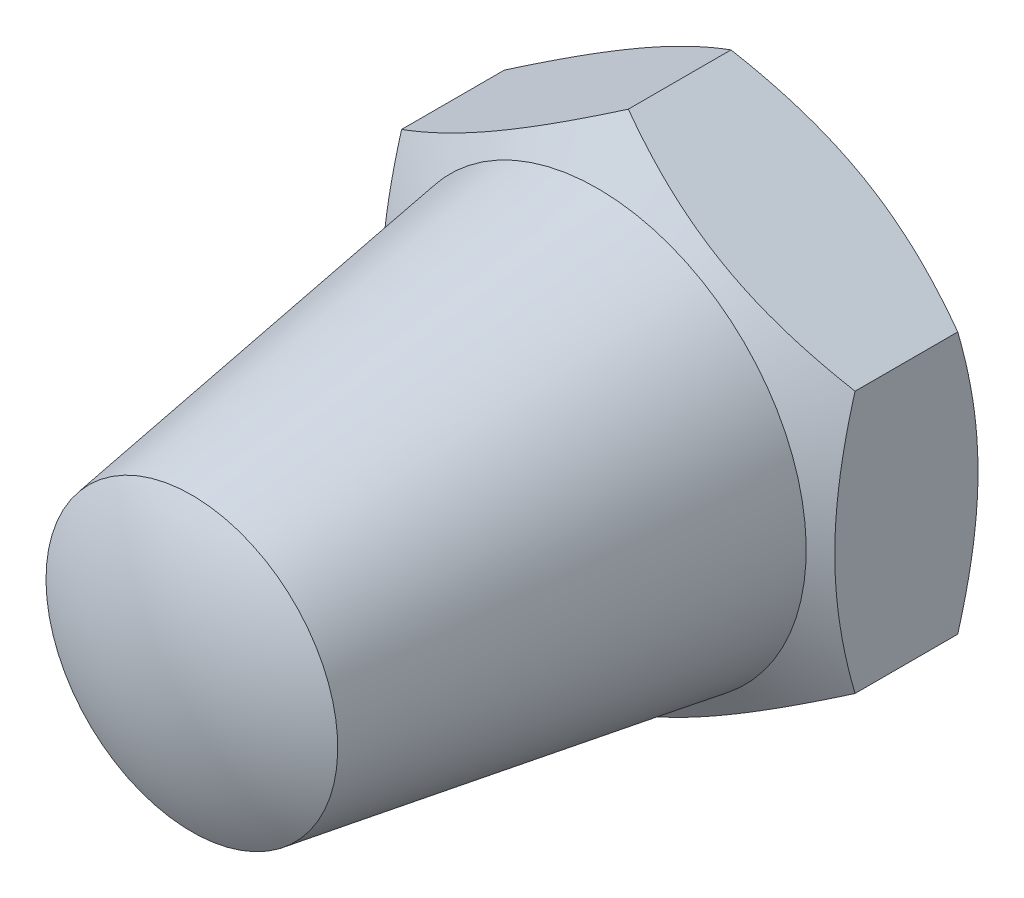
ISO-10303-21;
HEADER;
FILE_DESCRIPTION(('STEP AP214'),'2;1');
FILE_NAME('part.step','',(''),(''),'','','');
FILE_SCHEMA(('AUTOMOTIVE_DESIGN { 1 0 10303 214 1 1 1 1 }'));
ENDSEC;
DATA;
#1=APPLICATION_CONTEXT('core data for automotive mechanical design processes');
#2=APPLICATION_PROTOCOL_DEFINITION('international standard','automotive_design',2000,#1);
#3=PRODUCT_CONTEXT('',#1,'mechanical');
#4=PRODUCT('Part','Part','',(#3));
#5=PRODUCT_RELATED_PRODUCT_CATEGORY('part','',(#4));
#6=PRODUCT_DEFINITION_FORMATION('','',#4);
#7=PRODUCT_DEFINITION_CONTEXT('part definition',#1,'design');
#8=PRODUCT_DEFINITION('design','',#6,#7);
#9=PRODUCT_DEFINITION_SHAPE('','',#8);
#10=(LENGTH_UNIT() NAMED_UNIT(*) SI_UNIT(.MILLI.,.METRE.));
#11=(NAMED_UNIT(*) PLANE_ANGLE_UNIT() SI_UNIT($,.RADIAN.));
#12=(NAMED_UNIT(*) SI_UNIT($,.STERADIAN.) SOLID_ANGLE_UNIT());
#13=UNCERTAINTY_MEASURE_WITH_UNIT(LENGTH_MEASURE(1.E-05),#10,'distance_accuracy_value','');
#14=(GEOMETRIC_REPRESENTATION_CONTEXT(3) GLOBAL_UNCERTAINTY_ASSIGNED_CONTEXT((#13)) GLOBAL_UNIT_ASSIGNED_CONTEXT((#10,
#11,#12)) REPRESENTATION_CONTEXT('',''));
#15=CARTESIAN_POINT('',(0.,0.,0.));
#16=DIRECTION('',(0.,0.,1.));
#17=DIRECTION('',(1.,0.,0.));
#18=AXIS2_PLACEMENT_3D('',#15,#16,#17);
#19=CARTESIAN_POINT('',(0.,0.,0.));
#20=DIRECTION('',(0.,0.,1.));
#21=DIRECTION('',(-0.500000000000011,-0.866025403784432,0.));
#22=AXIS2_PLACEMENT_3D('',#19,#20,#21);
#23=CONICAL_SURFACE('',#22,9.5,1.04719755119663);
#24=CARTESIAN_POINT('',(-9.5,-5.48505849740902,0.848572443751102));
#25=CARTESIAN_POINT('',(-9.5,-5.24392149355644,0.778973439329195));
#26=CARTESIAN_POINT('',(-9.5,-5.00188540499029,0.7125333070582));
#27=CARTESIAN_POINT('',(-9.5,-4.51587227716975,0.586847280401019));
#28=CARTESIAN_POINT('',(-9.5,-4.27189462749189,0.527603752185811));
#29=CARTESIAN_POINT('',(-9.5,-3.53603045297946,0.361814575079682));
#30=CARTESIAN_POINT('',(-9.5,-3.04123900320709,0.267514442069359));
#31=CARTESIAN_POINT('',(-9.5,-2.30080624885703,0.156938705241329));
#32=CARTESIAN_POINT('',(-9.5,-2.05737704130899,0.125439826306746));
#33=CARTESIAN_POINT('',(-9.5,-1.56939156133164,0.0726182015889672));
#34=CARTESIAN_POINT('',(-9.5,-1.32483526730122,0.0512956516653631));
#35=CARTESIAN_POINT('',(-9.5,-0.835314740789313,0.0193730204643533));
#36=CARTESIAN_POINT('',(-9.5,-0.590351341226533,0.0087601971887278));
#37=CARTESIAN_POINT('',(-9.5,-0.100198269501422,-0.00151746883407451));
#38=CARTESIAN_POINT('',(-9.5,0.144991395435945,-0.00118264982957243));
#39=CARTESIAN_POINT('',(-9.5,0.603379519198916,0.00967336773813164));
#40=CARTESIAN_POINT('',(-9.5,0.816610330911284,0.0188702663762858));
#41=CARTESIAN_POINT('',(-9.5,1.2425732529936,0.0453653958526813));
#42=CARTESIAN_POINT('',(-9.5,1.45530532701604,0.0626641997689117));
#43=CARTESIAN_POINT('',(-9.5,2.09267726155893,0.126304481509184));
#44=CARTESIAN_POINT('',(-9.5,2.51618892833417,0.184381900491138));
#45=CARTESIAN_POINT('',(-9.5,3.36770470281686,0.329576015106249));
#46=CARTESIAN_POINT('',(-9.5,3.79560013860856,0.417308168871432));
#47=CARTESIAN_POINT('',(-9.5,4.64501006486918,0.616423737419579));
#48=CARTESIAN_POINT('',(-9.5,5.06653543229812,0.727760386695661));
#49=CARTESIAN_POINT('',(-9.5,5.4850584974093,0.848572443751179));
#50=B_SPLINE_CURVE_WITH_KNOTS('',3,(#24,#25,#26,#27,#28,#29,#30,#31,#32,#33,#34,#35,#36,#37,#38,
#39,#40,#41,#42,#43,#44,#45,#46,#47,#48,#49),.UNSPECIFIED.,.F.,.F.,(4,2,2,2,2,2,2,2,2,2,2,2,4),
(0.,0.752880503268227,1.50600787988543,3.01546870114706,3.75167336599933,4.4878921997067,
5.22323407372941,5.95855322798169,6.59868084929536,7.23885375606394,8.52010929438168,
9.82978009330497,11.1368800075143),.UNSPECIFIED.);
#51=CARTESIAN_POINT('',(-9.5,0.,0.));
#52=VERTEX_POINT('',#51);
#53=CARTESIAN_POINT('',(-9.5,5.48482755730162,0.848505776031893));
#54=VERTEX_POINT('',#53);
#55=EDGE_CURVE('E144',#52,#54,#50,.T.);
#56=ORIENTED_EDGE('',*,*,#55,.T.);
#57=CARTESIAN_POINT('',(-9.5002,5.48471208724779,0.848572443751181));
#58=CARTESIAN_POINT('',(-9.2913692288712,5.60528058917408,0.778973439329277));
#59=CARTESIAN_POINT('',(-9.08175982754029,5.72629863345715,0.712533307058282));
#60=CARTESIAN_POINT('',(-8.66086011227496,5.96930519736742,0.586847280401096));
#61=CARTESIAN_POINT('',(-8.44956926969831,6.09129402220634,0.527603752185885));
#62=CARTESIAN_POINT('',(-7.81229220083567,6.45922610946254,0.361814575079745));
#63=CARTESIAN_POINT('',(-7.38379023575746,6.70662183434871,0.267514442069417));
#64=CARTESIAN_POINT('',(-6.7425566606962,7.07683821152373,0.156938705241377));
#65=CARTESIAN_POINT('',(-6.53174078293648,7.19855281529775,0.12543982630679));
#66=CARTESIAN_POINT('',(-6.10913296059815,7.44254555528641,0.0726182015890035));
#67=CARTESIAN_POINT('',(-5.89734099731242,7.56482370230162,0.0512956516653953));
#68=CARTESIAN_POINT('',(-5.47340378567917,7.80958396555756,0.0193730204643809));
#69=CARTESIAN_POINT('',(-5.26125925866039,7.93206566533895,0.00876019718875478));
#70=CARTESIAN_POINT('',(-4.83677424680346,8.17714220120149,-0.00151746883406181));
#71=CARTESIAN_POINT('',(-4.62443376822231,8.29973703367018,-0.00118264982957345));
#72=CARTESIAN_POINT('',(-4.22745800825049,8.52893109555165,0.00967336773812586));
#73=CARTESIAN_POINT('',(-4.042794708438,8.63554650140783,0.0188702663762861));
#74=CARTESIAN_POINT('',(-3.67389999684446,8.84852796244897,0.0453653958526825));
#75=CARTESIAN_POINT('',(-3.48966861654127,8.95489399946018,0.0626641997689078));
#76=CARTESIAN_POINT('',(-2.9376883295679,9.27357996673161,0.126304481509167));
#77=CARTESIAN_POINT('',(-2.57091646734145,9.48533580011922,0.184381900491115));
#78=CARTESIAN_POINT('',(-1.83348217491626,9.91109368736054,0.329576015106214));
#79=CARTESIAN_POINT('',(-1.46291385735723,10.1250414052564,0.417308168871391));
#80=CARTESIAN_POINT('',(-0.727303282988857,10.5497463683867,0.616423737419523));
#81=CARTESIAN_POINT('',(-0.362251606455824,10.7605090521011,0.727760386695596));
#82=CARTESIAN_POINT('',(0.000200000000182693,10.9697705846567,0.848572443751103));
#83=B_SPLINE_CURVE_WITH_KNOTS('',3,(#57,#58,#59,#60,#61,#62,#63,#64,#65,#66,#67,#68,#69,#70,#71,
#72,#73,#74,#75,#76,#77,#78,#79,#80,#81,#82),.UNSPECIFIED.,.F.,.F.,(4,2,2,2,2,2,2,2,2,2,2,2,4),
(0.,0.752880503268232,1.50600787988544,3.01546870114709,3.75167336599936,4.48789219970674,
5.22323407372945,5.95855322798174,6.5986808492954,7.23885375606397,8.52010929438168,
9.82978009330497,11.1368800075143),.UNSPECIFIED.);
#84=CARTESIAN_POINT('',(-4.74999999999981,8.2272413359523,0.));
#85=VERTEX_POINT('',#84);
#86=EDGE_CURVE('E96',#54,#85,#83,.T.);
#87=ORIENTED_EDGE('',*,*,#86,.T.);
#88=CARTESIAN_POINT('',(0.,0.,0.));
#89=DIRECTION('',(0.,0.,-1.));
#90=DIRECTION('',(0.500000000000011,0.866025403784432,0.));
#91=AXIS2_PLACEMENT_3D('',#88,#89,#90);
#92=CIRCLE('',#91,9.5);
#93=EDGE_CURVE('E107',#52,#85,#92,.T.);
#94=ORIENTED_EDGE('',*,*,#93,.F.);
#95=EDGE_LOOP('',(#56,#87,#94));
#96=FACE_BOUND('',#95,.T.);
#97=ADVANCED_FACE('F14',(#96),#23,.T.);
#98=CARTESIAN_POINT('',(4.75000000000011,8.22724133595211,0.));
#99=VERTEX_POINT('',#98);
#100=EDGE_CURVE('E104',#85,#99,#92,.T.);
#101=ORIENTED_EDGE('',*,*,#100,.F.);
#102=CARTESIAN_POINT('',(1.81278603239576E-13,10.9696551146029,0.848505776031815));
#103=VERTEX_POINT('',#102);
#104=EDGE_CURVE('E110',#85,#103,#83,.T.);
#105=ORIENTED_EDGE('',*,*,#104,.T.);
#106=CARTESIAN_POINT('',(-8.10797626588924,15.6507973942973,4.69172618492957));
#107=CARTESIAN_POINT('',(-7.92789754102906,15.546828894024,4.59060472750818));
#108=CARTESIAN_POINT('',(-7.74761015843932,15.4427399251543,4.48997893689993));
#109=CARTESIAN_POINT('',(-7.38657458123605,15.234295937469,4.28983072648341));
#110=CARTESIAN_POINT('',(-7.20582638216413,15.1299409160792,4.19030831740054));
#111=CARTESIAN_POINT('',(-6.66277851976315,14.8164120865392,3.89353871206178));
#112=CARTESIAN_POINT('',(-6.29972734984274,14.606804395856,3.69811828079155));
#113=CARTESIAN_POINT('',(-5.56929946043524,14.185091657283,3.3122810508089));
#114=CARTESIAN_POINT('',(-5.20191001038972,13.9729792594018,3.12189630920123));
#115=CARTESIAN_POINT('',(-4.46424418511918,13.5470876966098,2.74876351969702));
#116=CARTESIAN_POINT('',(-4.09396794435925,13.3333086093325,2.56601511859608));
#117=CARTESIAN_POINT('',(-3.33759312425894,12.8966154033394,2.20426740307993));
#118=CARTESIAN_POINT('',(-2.9513771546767,12.6736335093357,2.02559358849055));
#119=CARTESIAN_POINT('',(-2.17446433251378,12.2250826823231,1.68149388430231));
#120=CARTESIAN_POINT('',(-1.78376698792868,11.9995134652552,1.5160694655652));
#121=CARTESIAN_POINT('',(-0.997964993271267,11.54583047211,1.20272862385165));
#122=CARTESIAN_POINT('',(-0.602870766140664,11.3177227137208,1.05477771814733));
#123=CARTESIAN_POINT('',(0.192970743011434,10.8582434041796,0.781054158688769));
#124=CARTESIAN_POINT('',(0.593716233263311,10.6268728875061,0.655274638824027));
#125=CARTESIAN_POINT('',(1.39889929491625,10.1620002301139,0.432540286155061));
#126=CARTESIAN_POINT('',(1.80330250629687,9.9285179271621,0.335424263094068));
#127=CARTESIAN_POINT('',(2.41366801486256,9.57612323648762,0.215390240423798));
#128=CARTESIAN_POINT('',(2.61776427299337,9.45828820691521,0.179650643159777));
#129=CARTESIAN_POINT('',(3.02700454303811,9.22201322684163,0.117416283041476));
#130=CARTESIAN_POINT('',(3.23214845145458,9.10357333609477,0.0909206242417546));
#131=CARTESIAN_POINT('',(3.64048628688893,8.86781937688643,0.0480403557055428));
#132=CARTESIAN_POINT('',(3.8436699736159,8.75051122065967,0.0315262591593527));
#133=CARTESIAN_POINT('',(4.25046039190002,8.51565066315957,0.00844006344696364));
#134=CARTESIAN_POINT('',(4.45406711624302,8.39809826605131,0.00186779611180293));
#135=CARTESIAN_POINT('',(4.86133866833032,8.16295992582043,-0.00117752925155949));
#136=CARTESIAN_POINT('',(5.06500349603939,8.04537398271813,0.0023494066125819));
#137=CARTESIAN_POINT('',(5.47202077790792,7.8103824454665,0.019414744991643));
#138=CARTESIAN_POINT('',(5.67537321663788,7.6929768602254,0.0329536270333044));
#139=CARTESIAN_POINT('',(6.16113213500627,7.41252381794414,0.0769634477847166));
#140=CARTESIAN_POINT('',(6.44323555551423,7.24965133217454,0.111994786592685));
#141=CARTESIAN_POINT('',(7.00539980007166,6.92508565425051,0.199439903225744));
#142=CARTESIAN_POINT('',(7.28546035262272,6.76339261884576,0.251855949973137));
#143=CARTESIAN_POINT('',(8.12222981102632,6.28028354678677,0.432406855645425));
#144=CARTESIAN_POINT('',(8.67522538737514,5.9610114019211,0.583813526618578));
#145=CARTESIAN_POINT('',(9.5022120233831,5.48355044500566,0.847120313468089));
#146=CARTESIAN_POINT('',(9.78047555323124,5.32289492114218,0.942164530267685));
#147=CARTESIAN_POINT('',(10.3343017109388,5.00314323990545,1.1423154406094));
#148=CARTESIAN_POINT('',(10.6098643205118,4.84404709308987,1.24742220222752));
#149=CARTESIAN_POINT('',(11.158371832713,4.52736613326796,1.46599605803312));
#150=CARTESIAN_POINT('',(11.4313175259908,4.36978086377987,1.57946053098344));
#151=CARTESIAN_POINT('',(11.9749367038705,4.05592218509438,1.81339584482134));
#152=CARTESIAN_POINT('',(12.2456102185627,3.89964875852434,1.93386659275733));
#153=CARTESIAN_POINT('',(12.8973907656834,3.52334308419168,2.23211274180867));
#154=CARTESIAN_POINT('',(13.2774841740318,3.30389605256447,2.41283667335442));
#155=CARTESIAN_POINT('',(14.0343134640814,2.86694045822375,2.78345507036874));
#156=CARTESIAN_POINT('',(14.4110491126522,2.64943203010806,2.97335016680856));
#157=CARTESIAN_POINT('',(15.1618084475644,2.21598092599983,3.36042547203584));
#158=CARTESIAN_POINT('',(15.5358314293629,2.00003865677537,3.557607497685));
#159=CARTESIAN_POINT('',(16.2815366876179,1.5695055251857,3.95774536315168));
#160=CARTESIAN_POINT('',(16.6532190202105,1.35491463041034,4.16070106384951));
#161=CARTESIAN_POINT('',(17.3950830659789,0.926599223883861,4.5715234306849));
#162=CARTESIAN_POINT('',(17.7652624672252,0.712876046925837,4.77939565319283));
#163=CARTESIAN_POINT('',(18.5039939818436,0.286369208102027,5.19895991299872));
#164=CARTESIAN_POINT('',(18.8725460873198,0.0735855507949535,5.41065196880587));
#165=CARTESIAN_POINT('',(19.6082260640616,-0.351159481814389,5.83715506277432));
#166=CARTESIAN_POINT('',(19.9753541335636,-0.563120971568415,6.05196564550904));
#167=CARTESIAN_POINT('',(20.7084491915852,-0.986373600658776,6.48421388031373));
#168=CARTESIAN_POINT('',(21.0744161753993,-1.19766473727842,6.70165154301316));
#169=CARTESIAN_POINT('',(22.1069850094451,-1.79381863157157,7.31908016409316));
#170=CARTESIAN_POINT('',(22.772437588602,-2.17801785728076,7.7216336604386));
#171=CARTESIAN_POINT('',(24.1008779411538,-2.94499325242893,8.53218731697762));
#172=CARTESIAN_POINT('',(24.7638656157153,-3.32776936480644,8.9401876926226));
#173=CARTESIAN_POINT('',(26.0861399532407,-4.09118480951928,9.75924293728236));
#174=CARTESIAN_POINT('',(26.7454317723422,-4.47182711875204,10.1702867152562));
#175=CARTESIAN_POINT('',(27.7332133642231,-5.04212308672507,10.7892558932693));
#176=CARTESIAN_POINT('',(28.0622716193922,-5.23210495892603,10.995973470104));
#177=CARTESIAN_POINT('',(28.7200473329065,-5.6118719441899,11.4101289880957));
#178=CARTESIAN_POINT('',(29.0487647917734,-5.80165705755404,11.6175669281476));
#179=CARTESIAN_POINT('',(29.3773314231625,-5.99135509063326,11.825323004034));
#180=B_SPLINE_CURVE_WITH_KNOTS('',3,(#106,#107,#108,#109,#110,#111,#112,#113,#114,#115,#116,
#117,#118,#119,#120,#121,#122,#123,#124,#125,#126,#127,#128,#129,#130,#131,#132,#133,#134,#135,
#136,#137,#138,#139,#140,#141,#142,#143,#144,#145,#146,#147,#148,#149,#150,#151,#152,#153,#154,
#155,#156,#157,#158,#159,#160,#161,#162,#163,#164,#165,#166,#167,#168,#169,#170,#171,#172,#173,
#174,#175,#176,#177,#178,#179),.UNSPECIFIED.,.F.,.F.,(4,2,2,2,2,2,2,2,2,2,2,2,2,2,2,2,2,2,2,2,2,
2,2,2,2,2,2,2,2,2,2,2,2,2,2,2,4),(0.,0.693663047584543,1.3873328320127,2.77487186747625,
4.16977436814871,5.56461227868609,7.00572345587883,8.44699439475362,9.88537180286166,
11.3233029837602,12.7529867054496,13.4679278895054,14.1827997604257,14.8881868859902,
15.5935620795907,16.2989368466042,17.0043454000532,17.9866623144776,18.9691074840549,
20.9350403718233,21.940173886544,22.9453142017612,23.9501406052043,24.9549536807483,
26.3787498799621,27.8026441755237,29.2268959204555,30.6511133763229,32.0770255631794,
33.5029446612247,34.9286575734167,36.3543762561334,38.956720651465,41.5591682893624,
44.154653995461,45.4523211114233,46.7499862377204),.UNSPECIFIED.);
#181=EDGE_CURVE('E182',#103,#99,#180,.T.);
#182=ORIENTED_EDGE('',*,*,#181,.T.);
#183=EDGE_LOOP('',(#101,#105,#182));
#184=FACE_BOUND('',#183,.T.);
#185=ADVANCED_FACE('F139',(#184),#23,.T.);
#186=CARTESIAN_POINT('',(9.5,0.,0.));
#187=VERTEX_POINT('',#186);
#188=EDGE_CURVE('E109',#99,#187,#92,.T.);
#189=ORIENTED_EDGE('',*,*,#188,.F.);
#190=CARTESIAN_POINT('',(9.5,5.48482755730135,0.848505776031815));
#191=VERTEX_POINT('',#190);
#192=EDGE_CURVE('E175',#99,#191,#180,.T.);
#193=ORIENTED_EDGE('',*,*,#192,.T.);
#194=CARTESIAN_POINT('',(9.5,5.48505849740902,0.848572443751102));
#195=CARTESIAN_POINT('',(9.5,5.24392149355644,0.778973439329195));
#196=CARTESIAN_POINT('',(9.5,5.00188540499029,0.7125333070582));
#197=CARTESIAN_POINT('',(9.5,4.51587227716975,0.586847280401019));
#198=CARTESIAN_POINT('',(9.5,4.27189462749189,0.527603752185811));
#199=CARTESIAN_POINT('',(9.5,3.53603045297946,0.361814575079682));
#200=CARTESIAN_POINT('',(9.5,3.04123900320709,0.267514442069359));
#201=CARTESIAN_POINT('',(9.5,2.30080624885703,0.156938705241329));
#202=CARTESIAN_POINT('',(9.5,2.05737704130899,0.125439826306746));
#203=CARTESIAN_POINT('',(9.5,1.56939156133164,0.0726182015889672));
#204=CARTESIAN_POINT('',(9.5,1.32483526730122,0.0512956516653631));
#205=CARTESIAN_POINT('',(9.5,0.835314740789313,0.0193730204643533));
#206=CARTESIAN_POINT('',(9.5,0.590351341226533,0.0087601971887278));
#207=CARTESIAN_POINT('',(9.5,0.100198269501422,-0.00151746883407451));
#208=CARTESIAN_POINT('',(9.5,-0.144991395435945,-0.00118264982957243));
#209=CARTESIAN_POINT('',(9.5,-0.603379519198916,0.00967336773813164));
#210=CARTESIAN_POINT('',(9.5,-0.816610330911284,0.0188702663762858));
#211=CARTESIAN_POINT('',(9.5,-1.2425732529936,0.0453653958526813));
#212=CARTESIAN_POINT('',(9.5,-1.45530532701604,0.0626641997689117));
#213=CARTESIAN_POINT('',(9.5,-2.09267726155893,0.126304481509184));
#214=CARTESIAN_POINT('',(9.5,-2.51618892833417,0.184381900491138));
#215=CARTESIAN_POINT('',(9.5,-3.36770470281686,0.329576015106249));
#216=CARTESIAN_POINT('',(9.5,-3.79560013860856,0.417308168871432));
#217=CARTESIAN_POINT('',(9.5,-4.64501006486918,0.616423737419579));
#218=CARTESIAN_POINT('',(9.5,-5.06653543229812,0.727760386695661));
#219=CARTESIAN_POINT('',(9.5,-5.4850584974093,0.848572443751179));
#220=B_SPLINE_CURVE_WITH_KNOTS('',3,(#194,#195,#196,#197,#198,#199,#200,#201,#202,#203,#204,
#205,#206,#207,#208,#209,#210,#211,#212,#213,#214,#215,#216,#217,#218,#219),.UNSPECIFIED.,.F.,
.F.,(4,2,2,2,2,2,2,2,2,2,2,2,4),(0.,0.752880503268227,1.50600787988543,3.01546870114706,
3.75167336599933,4.4878921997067,5.22323407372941,5.95855322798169,6.59868084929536,
7.23885375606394,8.52010929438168,9.82978009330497,11.1368800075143),.UNSPECIFIED.);
#221=EDGE_CURVE('E219',#191,#187,#220,.T.);
#222=ORIENTED_EDGE('',*,*,#221,.T.);
#223=EDGE_LOOP('',(#189,#193,#222));
#224=FACE_BOUND('',#223,.T.);
#225=ADVANCED_FACE('F282',(#224),#23,.T.);
#226=CARTESIAN_POINT('',(4.7499999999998,-8.22724133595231,0.));
#227=VERTEX_POINT('',#226);
#228=EDGE_CURVE('E271',#187,#227,#92,.T.);
#229=ORIENTED_EDGE('',*,*,#228,.F.);
#230=CARTESIAN_POINT('',(9.5,-5.48482755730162,0.848505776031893));
#231=VERTEX_POINT('',#230);
#232=EDGE_CURVE('E167',#187,#231,#220,.T.);
#233=ORIENTED_EDGE('',*,*,#232,.T.);
#234=CARTESIAN_POINT('',(9.5002,-5.48471208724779,0.848572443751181));
#235=CARTESIAN_POINT('',(9.2913692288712,-5.60528058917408,0.778973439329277));
#236=CARTESIAN_POINT('',(9.08175982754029,-5.72629863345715,0.712533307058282));
#237=CARTESIAN_POINT('',(8.66086011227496,-5.96930519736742,0.586847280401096));
#238=CARTESIAN_POINT('',(8.44956926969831,-6.09129402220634,0.527603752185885));
#239=CARTESIAN_POINT('',(7.81229220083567,-6.45922610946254,0.361814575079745));
#240=CARTESIAN_POINT('',(7.38379023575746,-6.70662183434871,0.267514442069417));
#241=CARTESIAN_POINT('',(6.7425566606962,-7.07683821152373,0.156938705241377));
#242=CARTESIAN_POINT('',(6.53174078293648,-7.19855281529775,0.12543982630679));
#243=CARTESIAN_POINT('',(6.10913296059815,-7.44254555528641,0.0726182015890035));
#244=CARTESIAN_POINT('',(5.89734099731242,-7.56482370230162,0.0512956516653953));
#245=CARTESIAN_POINT('',(5.47340378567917,-7.80958396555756,0.0193730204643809));
#246=CARTESIAN_POINT('',(5.26125925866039,-7.93206566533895,0.00876019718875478));
#247=CARTESIAN_POINT('',(4.83677424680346,-8.17714220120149,-0.00151746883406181));
#248=CARTESIAN_POINT('',(4.62443376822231,-8.29973703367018,-0.00118264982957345));
#249=CARTESIAN_POINT('',(4.22745800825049,-8.52893109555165,0.00967336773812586));
#250=CARTESIAN_POINT('',(4.042794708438,-8.63554650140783,0.0188702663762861));
#251=CARTESIAN_POINT('',(3.67389999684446,-8.84852796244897,0.0453653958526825));
#252=CARTESIAN_POINT('',(3.48966861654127,-8.95489399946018,0.0626641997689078));
#253=CARTESIAN_POINT('',(2.9376883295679,-9.27357996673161,0.126304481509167));
#254=CARTESIAN_POINT('',(2.57091646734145,-9.48533580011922,0.184381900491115));
#255=CARTESIAN_POINT('',(1.83348217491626,-9.91109368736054,0.329576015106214));
#256=CARTESIAN_POINT('',(1.46291385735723,-10.1250414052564,0.417308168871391));
#257=CARTESIAN_POINT('',(0.727303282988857,-10.5497463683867,0.616423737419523));
#258=CARTESIAN_POINT('',(0.362251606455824,-10.7605090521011,0.727760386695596));
#259=CARTESIAN_POINT('',(-0.000200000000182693,-10.9697705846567,0.848572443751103));
#260=B_SPLINE_CURVE_WITH_KNOTS('',3,(#234,#235,#236,#237,#238,#239,#240,#241,#242,#243,#244,
#245,#246,#247,#248,#249,#250,#251,#252,#253,#254,#255,#256,#257,#258,#259),.UNSPECIFIED.,.F.,
.F.,(4,2,2,2,2,2,2,2,2,2,2,2,4),(0.,0.752880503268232,1.50600787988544,3.01546870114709,
3.75167336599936,4.48789219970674,5.22323407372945,5.95855322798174,6.5986808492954,
7.23885375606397,8.52010929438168,9.82978009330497,11.1368800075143),.UNSPECIFIED.);
#261=EDGE_CURVE('E217',#231,#227,#260,.T.);
#262=ORIENTED_EDGE('',*,*,#261,.T.);
#263=EDGE_LOOP('',(#229,#233,#262));
#264=FACE_BOUND('',#263,.T.);
#265=ADVANCED_FACE('F283',(#264),#23,.T.);
#266=CARTESIAN_POINT('',(-4.75000000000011,-8.22724133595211,0.));
#267=VERTEX_POINT('',#266);
#268=EDGE_CURVE('E277',#227,#267,#92,.T.);
#269=ORIENTED_EDGE('',*,*,#268,.F.);
#270=CARTESIAN_POINT('',(-1.81278603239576E-13,-10.9696551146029,0.848505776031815));
#271=VERTEX_POINT('',#270);
#272=EDGE_CURVE('E159',#227,#271,#260,.T.);
#273=ORIENTED_EDGE('',*,*,#272,.T.);
#274=CARTESIAN_POINT('',(-17.6079762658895,-0.803685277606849,4.69172618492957));
#275=CARTESIAN_POINT('',(-17.4278975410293,-0.907653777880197,4.59060472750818));
#276=CARTESIAN_POINT('',(-17.2476101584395,-1.01174274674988,4.48997893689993));
#277=CARTESIAN_POINT('',(-16.8865745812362,-1.22018673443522,4.28983072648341));
#278=CARTESIAN_POINT('',(-16.7058263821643,-1.32454175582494,4.19030831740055));
#279=CARTESIAN_POINT('',(-16.1627785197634,-1.63807058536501,3.89353871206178));
#280=CARTESIAN_POINT('',(-15.7997273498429,-1.84767827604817,3.69811828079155));
#281=CARTESIAN_POINT('',(-15.0692994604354,-2.26939101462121,3.3122810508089));
#282=CARTESIAN_POINT('',(-14.7019100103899,-2.48150341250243,3.12189630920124));
#283=CARTESIAN_POINT('',(-13.9642441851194,-2.90739497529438,2.74876351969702));
#284=CARTESIAN_POINT('',(-13.5939679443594,-3.12117406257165,2.56601511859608));
#285=CARTESIAN_POINT('',(-12.8375931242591,-3.55786726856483,2.20426740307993));
#286=CARTESIAN_POINT('',(-12.4513771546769,-3.78084916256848,2.02559358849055));
#287=CARTESIAN_POINT('',(-11.674464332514,-4.22939998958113,1.68149388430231));
#288=CARTESIAN_POINT('',(-11.2837669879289,-4.45496920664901,1.5160694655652));
#289=CARTESIAN_POINT('',(-10.4979649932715,-4.90865219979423,1.20272862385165));
#290=CARTESIAN_POINT('',(-10.1028707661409,-5.13675995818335,1.05477771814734));
#291=CARTESIAN_POINT('',(-9.30702925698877,-5.59623926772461,0.78105415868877));
#292=CARTESIAN_POINT('',(-8.9062837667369,-5.82760978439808,0.655274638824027));
#293=CARTESIAN_POINT('',(-8.10110070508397,-6.29248244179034,0.43254028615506));
#294=CARTESIAN_POINT('',(-7.69669749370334,-6.52596474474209,0.335424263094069));
#295=CARTESIAN_POINT('',(-7.08633198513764,-6.87835943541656,0.215390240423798));
#296=CARTESIAN_POINT('',(-6.88223572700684,-6.99619446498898,0.179650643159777));
#297=CARTESIAN_POINT('',(-6.47299545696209,-7.23246944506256,0.117416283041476));
#298=CARTESIAN_POINT('',(-6.26785154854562,-7.35090933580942,0.090920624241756));
#299=CARTESIAN_POINT('',(-5.85951371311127,-7.58666329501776,0.0480403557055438));
#300=CARTESIAN_POINT('',(-5.65633002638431,-7.70397145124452,0.0315262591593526));
#301=CARTESIAN_POINT('',(-5.24953960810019,-7.93883200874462,0.00844006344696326));
#302=CARTESIAN_POINT('',(-5.04593288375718,-8.05638440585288,0.0018677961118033));
#303=CARTESIAN_POINT('',(-4.63866133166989,-8.29152274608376,-0.00117752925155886));
#304=CARTESIAN_POINT('',(-4.43499650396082,-8.40910868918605,0.00234940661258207));
#305=CARTESIAN_POINT('',(-4.02797922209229,-8.64410022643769,0.0194147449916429));
#306=CARTESIAN_POINT('',(-3.82462678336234,-8.76150581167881,0.0329536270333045));
#307=CARTESIAN_POINT('',(-3.33886786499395,-9.04195885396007,0.0769634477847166));
#308=CARTESIAN_POINT('',(-3.05676444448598,-9.20483133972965,0.111994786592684));
#309=CARTESIAN_POINT('',(-2.49460019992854,-9.52939701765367,0.199439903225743));
#310=CARTESIAN_POINT('',(-2.21453964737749,-9.69109005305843,0.251855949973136));
#311=CARTESIAN_POINT('',(-1.37777018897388,-10.1741991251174,0.432406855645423));
#312=CARTESIAN_POINT('',(-0.824774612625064,-10.4934712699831,0.583813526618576));
#313=CARTESIAN_POINT('',(0.00221202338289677,-10.9709322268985,0.847120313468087));
#314=CARTESIAN_POINT('',(0.280475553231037,-11.131587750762,0.942164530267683));
#315=CARTESIAN_POINT('',(0.834301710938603,-11.4513394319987,1.1423154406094));
#316=CARTESIAN_POINT('',(1.10986432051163,-11.6104355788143,1.24742220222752));
#317=CARTESIAN_POINT('',(1.65837183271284,-11.9271165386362,1.46599605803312));
#318=CARTESIAN_POINT('',(1.93131752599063,-12.0847018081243,1.57946053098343));
#319=CARTESIAN_POINT('',(2.47493670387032,-12.3985604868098,1.81339584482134));
#320=CARTESIAN_POINT('',(2.74561021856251,-12.5548339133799,1.93386659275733));
#321=CARTESIAN_POINT('',(3.39739076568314,-12.9311395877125,2.23211274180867));
#322=CARTESIAN_POINT('',(3.77748417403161,-13.1505866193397,2.41283667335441));
#323=CARTESIAN_POINT('',(4.53431346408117,-13.5875422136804,2.78345507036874));
#324=CARTESIAN_POINT('',(4.91104911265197,-13.8050506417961,2.97335016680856));
#325=CARTESIAN_POINT('',(5.66180844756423,-14.2385017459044,3.36042547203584));
#326=CARTESIAN_POINT('',(6.0358314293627,-14.4544440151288,3.557607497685));
#327=CARTESIAN_POINT('',(6.78153668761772,-14.8849771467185,3.95774536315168));
#328=CARTESIAN_POINT('',(7.15321902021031,-15.0995680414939,4.16070106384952));
#329=CARTESIAN_POINT('',(7.89508306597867,-15.5278834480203,4.5715234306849));
#330=CARTESIAN_POINT('',(8.26526246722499,-15.7416066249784,4.77939565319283));
#331=CARTESIAN_POINT('',(9.0039939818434,-16.1681134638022,5.19895991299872));
#332=CARTESIAN_POINT('',(9.37254608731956,-16.3808971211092,5.41065196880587));
#333=CARTESIAN_POINT('',(10.1082260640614,-16.8056421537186,5.83715506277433));
#334=CARTESIAN_POINT('',(10.4753541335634,-17.0176036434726,6.05196564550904));
#335=CARTESIAN_POINT('',(11.208449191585,-17.440856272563,6.48421388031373));
#336=CARTESIAN_POINT('',(11.5744161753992,-17.6521474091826,6.70165154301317));
#337=CARTESIAN_POINT('',(12.6069850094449,-18.2483013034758,7.31908016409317));
#338=CARTESIAN_POINT('',(13.2724375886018,-18.632500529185,7.72163366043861));
#339=CARTESIAN_POINT('',(14.6008779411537,-19.3994759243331,8.53218731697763));
#340=CARTESIAN_POINT('',(15.2638656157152,-19.7822520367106,8.94018769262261));
#341=CARTESIAN_POINT('',(16.5861399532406,-20.5456674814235,9.75924293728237));
#342=CARTESIAN_POINT('',(17.245431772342,-20.9263097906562,10.1702867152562));
#343=CARTESIAN_POINT('',(18.2332133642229,-21.4966057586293,10.7892558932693));
#344=CARTESIAN_POINT('',(18.5622716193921,-21.6865876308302,10.995973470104));
#345=CARTESIAN_POINT('',(19.2200473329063,-22.0663546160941,11.4101289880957));
#346=CARTESIAN_POINT('',(19.5487647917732,-22.2561397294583,11.6175669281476));
#347=CARTESIAN_POINT('',(19.8773314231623,-22.4458377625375,11.825323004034));
#348=B_SPLINE_CURVE_WITH_KNOTS('',3,(#274,#275,#276,#277,#278,#279,#280,#281,#282,#283,#284,
#285,#286,#287,#288,#289,#290,#291,#292,#293,#294,#295,#296,#297,#298,#299,#300,#301,#302,#303,
#304,#305,#306,#307,#308,#309,#310,#311,#312,#313,#314,#315,#316,#317,#318,#319,#320,#321,#322,
#323,#324,#325,#326,#327,#328,#329,#330,#331,#332,#333,#334,#335,#336,#337,#338,#339,#340,#341,
#342,#343,#344,#345,#346,#347),.UNSPECIFIED.,.F.,.F.,(4,2,2,2,2,2,2,2,2,2,2,2,2,2,2,2,2,2,2,2,2,
2,2,2,2,2,2,2,2,2,2,2,2,2,2,2,4),(0.,0.693663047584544,1.3873328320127,2.77487186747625,
4.16977436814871,5.56461227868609,7.00572345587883,8.44699439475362,9.88537180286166,
11.3233029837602,12.7529867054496,13.4679278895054,14.1827997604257,14.8881868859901,
15.5935620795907,16.2989368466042,17.0043454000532,17.9866623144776,18.9691074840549,
20.9350403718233,21.940173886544,22.9453142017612,23.9501406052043,24.9549536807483,
26.3787498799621,27.8026441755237,29.2268959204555,30.6511133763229,32.0770255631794,
33.5029446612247,34.9286575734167,36.3543762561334,38.956720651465,41.5591682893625,
44.154653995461,45.4523211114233,46.7499862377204),.UNSPECIFIED.);
#349=EDGE_CURVE('E228',#271,#267,#348,.F.);
#350=ORIENTED_EDGE('',*,*,#349,.T.);
#351=EDGE_LOOP('',(#269,#273,#350));
#352=FACE_BOUND('',#351,.T.);
#353=ADVANCED_FACE('F286',(#352),#23,.T.);
#354=EDGE_CURVE('E239',#267,#52,#92,.T.);
#355=ORIENTED_EDGE('',*,*,#354,.F.);
#356=CARTESIAN_POINT('',(-9.5,-5.48482755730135,0.848505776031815));
#357=VERTEX_POINT('',#356);
#358=EDGE_CURVE('E87',#267,#357,#348,.F.);
#359=ORIENTED_EDGE('',*,*,#358,.T.);
#360=EDGE_CURVE('E88',#357,#52,#50,.T.);
#361=ORIENTED_EDGE('',*,*,#360,.T.);
#362=EDGE_LOOP('',(#355,#359,#361));
#363=FACE_BOUND('',#362,.T.);
#364=ADVANCED_FACE('F135',(#363),#23,.T.);
#365=CARTESIAN_POINT('',(8.22724133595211,-4.75000000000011,0.));
#366=DIRECTION('',(0.,0.,-1.));
#367=DIRECTION('',(0.500000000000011,0.866025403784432,0.));
#368=AXIS2_PLACEMENT_3D('',#365,#366,#367);
#369=PLANE('',#368);
#370=CARTESIAN_POINT('',(0.,0.,0.));
#371=DIRECTION('',(0.,0.,-1.));
#372=DIRECTION('',(-0.866025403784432,0.500000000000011,0.));
#373=AXIS2_PLACEMENT_3D('',#370,#371,#372);
#374=CIRCLE('',#373,6.);
#375=CARTESIAN_POINT('',(-5.19615242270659,3.00000000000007,0.));
#376=VERTEX_POINT('',#375);
#377=EDGE_CURVE('E256',#376,#376,#374,.T.);
#378=ORIENTED_EDGE('',*,*,#377,.F.);
#379=EDGE_LOOP('',(#378));
#380=FACE_BOUND('',#379,.T.);
#381=ORIENTED_EDGE('',*,*,#188,.T.);
#382=ORIENTED_EDGE('',*,*,#228,.T.);
#383=ORIENTED_EDGE('',*,*,#268,.T.);
#384=ORIENTED_EDGE('',*,*,#354,.T.);
#385=ORIENTED_EDGE('',*,*,#93,.T.);
#386=ORIENTED_EDGE('',*,*,#100,.T.);
#387=EDGE_LOOP('',(#381,#382,#383,#384,#385,#386));
#388=FACE_BOUND('',#387,.T.);
#389=ADVANCED_FACE('F130',(#380,#388),#369,.T.);
#390=CARTESIAN_POINT('',(1.81278603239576E-13,10.9696551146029,-25.));
#391=DIRECTION('',(-0.499999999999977,0.866025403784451,0.));
#392=DIRECTION('',(-0.866025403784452,-0.499999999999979,0.));
#393=AXIS2_PLACEMENT_3D('',#390,#391,#392);
#394=PLANE('',#393);
#395=DIRECTION('',(0.,0.,1.));
#396=VECTOR('',#395,1.);
#397=CARTESIAN_POINT('',(1.81278603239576E-13,10.9696551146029,-25.));
#398=LINE('',#397,#396);
#399=CARTESIAN_POINT('',(1.81278603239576E-13,10.9696551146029,5.15149422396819));
#400=VERTEX_POINT('',#399);
#401=EDGE_CURVE('E254',#103,#400,#398,.T.);
#402=ORIENTED_EDGE('',*,*,#401,.F.);
#403=ORIENTED_EDGE('',*,*,#104,.F.);
#404=ORIENTED_EDGE('',*,*,#86,.F.);
#405=DIRECTION('',(0.,0.,1.));
#406=VECTOR('',#405,1.);
#407=CARTESIAN_POINT('',(-9.5,5.48482755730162,-25.));
#408=LINE('',#407,#406);
#409=CARTESIAN_POINT('',(-9.5,5.48482755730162,5.15149422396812));
#410=VERTEX_POINT('',#409);
#411=EDGE_CURVE('E35',#54,#410,#408,.T.);
#412=ORIENTED_EDGE('',*,*,#411,.T.);
#413=CARTESIAN_POINT('',(0.000200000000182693,10.9697705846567,5.15142755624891));
#414=CARTESIAN_POINT('',(-0.208630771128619,10.8492020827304,5.22102656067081));
#415=CARTESIAN_POINT('',(-0.418240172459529,10.7281840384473,5.2874666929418));
#416=CARTESIAN_POINT('',(-0.83913988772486,10.4851774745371,5.41315271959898));
#417=CARTESIAN_POINT('',(-1.05043073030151,10.3631886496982,5.47239624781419));
#418=CARTESIAN_POINT('',(-1.68770779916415,9.99525656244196,5.63818542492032));
#419=CARTESIAN_POINT('',(-2.11620976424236,9.74786083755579,5.73248555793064));
#420=CARTESIAN_POINT('',(-2.75744333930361,9.37764446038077,5.84306129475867));
#421=CARTESIAN_POINT('',(-2.96825921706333,9.25592985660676,5.87456017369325));
#422=CARTESIAN_POINT('',(-3.39086703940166,9.0119371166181,5.92738179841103));
#423=CARTESIAN_POINT('',(-3.60265900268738,8.88965896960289,5.94870434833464));
#424=CARTESIAN_POINT('',(-4.02659621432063,8.64489870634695,5.98062697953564));
#425=CARTESIAN_POINT('',(-4.2387407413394,8.52241700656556,5.99123980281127));
#426=CARTESIAN_POINT('',(-4.66322575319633,8.27734047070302,6.00151746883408));
#427=CARTESIAN_POINT('',(-4.8755662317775,8.15474563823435,6.00118264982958));
#428=CARTESIAN_POINT('',(-5.27254199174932,7.92555157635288,5.99032663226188));
#429=CARTESIAN_POINT('',(-5.4572052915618,7.81893617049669,5.98112973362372));
#430=CARTESIAN_POINT('',(-5.82610000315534,7.60595470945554,5.95463460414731));
#431=CARTESIAN_POINT('',(-6.01033138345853,7.49958867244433,5.93733580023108));
#432=CARTESIAN_POINT('',(-6.56231167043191,7.1809027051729,5.87369551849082));
#433=CARTESIAN_POINT('',(-6.92908353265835,6.96914687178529,5.81561809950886));
#434=CARTESIAN_POINT('',(-7.66651782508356,6.54338898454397,5.67042398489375));
#435=CARTESIAN_POINT('',(-8.03708614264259,6.32944126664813,5.58269183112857));
#436=CARTESIAN_POINT('',(-8.77269671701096,5.90473630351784,5.38357626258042));
#437=CARTESIAN_POINT('',(-9.13774839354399,5.69397361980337,5.27223961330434));
#438=CARTESIAN_POINT('',(-9.5002,5.48471208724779,5.15142755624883));
#439=B_SPLINE_CURVE_WITH_KNOTS('',3,(#413,#414,#415,#416,#417,#418,#419,#420,#421,#422,#423,
#424,#425,#426,#427,#428,#429,#430,#431,#432,#433,#434,#435,#436,#437,#438),.UNSPECIFIED.,.F.,
.F.,(4,2,2,2,2,2,2,2,2,2,2,2,4),(0.,0.752880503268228,1.50600787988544,3.01546870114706,
3.75167336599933,4.4878921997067,5.22323407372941,5.95855322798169,6.59868084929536,
7.23885375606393,8.52010929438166,9.82978009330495,11.1368800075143),.UNSPECIFIED.);
#440=EDGE_CURVE('E93',#400,#410,#439,.T.);
#441=ORIENTED_EDGE('',*,*,#440,.F.);
#442=EDGE_LOOP('',(#402,#403,#404,#412,#441));
#443=FACE_BOUND('',#442,.T.);
#444=ADVANCED_FACE('F92',(#443),#394,.T.);
#445=CARTESIAN_POINT('',(9.5,5.48482755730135,-25.));
#446=DIRECTION('',(0.500000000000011,0.866025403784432,0.));
#447=DIRECTION('',(-0.866025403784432,0.500000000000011,0.));
#448=AXIS2_PLACEMENT_3D('',#445,#446,#447);
#449=PLANE('',#448);
#450=DIRECTION('',(0.,0.,1.));
#451=VECTOR('',#450,1.);
#452=CARTESIAN_POINT('',(9.5,5.48482755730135,-25.));
#453=LINE('',#452,#451);
#454=CARTESIAN_POINT('',(9.5,5.48482755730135,5.15149422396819));
#455=VERTEX_POINT('',#454);
#456=EDGE_CURVE('E251',#191,#455,#453,.T.);
#457=ORIENTED_EDGE('',*,*,#456,.F.);
#458=ORIENTED_EDGE('',*,*,#192,.F.);
#459=ORIENTED_EDGE('',*,*,#181,.F.);
#460=ORIENTED_EDGE('',*,*,#401,.T.);
#461=CARTESIAN_POINT('',(-8.0545953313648,15.6199778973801,1.33823181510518));
#462=CARTESIAN_POINT('',(-7.87473389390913,15.5161348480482,1.43910889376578));
#463=CARTESIAN_POINT('',(-7.69466261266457,15.4121706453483,1.53948688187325));
#464=CARTESIAN_POINT('',(-7.33405659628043,15.2039746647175,1.7391317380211));
#465=CARTESIAN_POINT('',(-7.15352185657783,15.0997428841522,1.83839859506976));
#466=CARTESIAN_POINT('',(-6.61110932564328,14.7865808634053,2.13438889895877));
#467=CARTESIAN_POINT('',(-6.24847574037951,14.577214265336,2.32927254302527));
#468=CARTESIAN_POINT('',(-5.51884523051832,14.1559618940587,2.71400300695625));
#469=CARTESIAN_POINT('',(-5.15183532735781,13.9440686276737,2.90381708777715));
#470=CARTESIAN_POINT('',(-4.41491282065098,13.5186062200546,3.27574988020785));
#471=CARTESIAN_POINT('',(-4.04500035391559,13.3050371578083,3.45786895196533));
#472=CARTESIAN_POINT('',(-3.28959731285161,12.8689050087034,3.81814124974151));
#473=CARTESIAN_POINT('',(-2.90399118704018,12.646275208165,3.99597319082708));
#474=CARTESIAN_POINT('',(-2.12828551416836,12.1984213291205,4.33830520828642));
#475=CARTESIAN_POINT('',(-1.73818547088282,11.9731969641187,4.50280379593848));
#476=CARTESIAN_POINT('',(-0.953581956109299,11.520205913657,4.81418869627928));
#477=CARTESIAN_POINT('',(-0.559089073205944,11.2924453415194,4.96111020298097));
#478=CARTESIAN_POINT('',(0.235541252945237,10.8336653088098,5.23266326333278));
#479=CARTESIAN_POINT('',(0.635676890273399,10.602646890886,5.35730178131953));
#480=CARTESIAN_POINT('',(1.43967094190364,10.1384607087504,5.57767285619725));
#481=CARTESIAN_POINT('',(1.84349604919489,9.90531217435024,5.67356307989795));
#482=CARTESIAN_POINT('',(2.45294712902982,9.55344542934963,5.79170894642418));
#483=CARTESIAN_POINT('',(2.65673092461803,9.43579080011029,5.82681089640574));
#484=CARTESIAN_POINT('',(3.0653268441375,9.19988783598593,5.8877644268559));
#485=CARTESIAN_POINT('',(3.27013886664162,9.08163955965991,5.91361690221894));
#486=CARTESIAN_POINT('',(3.67782041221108,8.84626450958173,5.9552293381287));
#487=CARTESIAN_POINT('',(3.88068008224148,8.72914342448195,5.97111749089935));
#488=CARTESIAN_POINT('',(4.28679962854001,8.49467019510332,5.99297114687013));
#489=CARTESIAN_POINT('',(4.49005949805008,8.37731805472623,5.99893681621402));
#490=CARTESIAN_POINT('',(4.89661614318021,8.14259246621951,6.00080302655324));
#491=CARTESIAN_POINT('',(5.09991291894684,8.02521901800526,5.9967035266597));
#492=CARTESIAN_POINT('',(5.50617487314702,7.79066356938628,5.97854027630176));
#493=CARTESIAN_POINT('',(5.70914003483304,7.67348157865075,5.96447603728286));
#494=CARTESIAN_POINT('',(6.19552296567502,7.39266826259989,5.91913176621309));
#495=CARTESIAN_POINT('',(6.47862342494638,7.22922013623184,5.88321395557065));
#496=CARTESIAN_POINT('',(7.04273994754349,6.90352731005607,5.79393895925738));
#497=CARTESIAN_POINT('',(7.32375572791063,6.74128277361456,5.74057944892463));
#498=CARTESIAN_POINT('',(8.16334316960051,6.25654673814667,5.55716611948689));
#499=CARTESIAN_POINT('',(8.71814835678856,5.93622981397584,5.40380988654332));
#500=CARTESIAN_POINT('',(9.54784658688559,5.45720331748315,5.13760699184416));
#501=CARTESIAN_POINT('',(9.827036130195,5.29601315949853,5.04158640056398));
#502=CARTESIAN_POINT('',(10.3827037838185,4.97519829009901,4.8395066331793));
#503=CARTESIAN_POINT('',(10.6591818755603,4.81557358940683,4.7334473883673));
#504=CARTESIAN_POINT('',(11.2095131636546,4.49783967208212,4.51299759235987));
#505=CARTESIAN_POINT('',(11.4833671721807,4.33972998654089,4.39860971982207));
#506=CARTESIAN_POINT('',(12.0288016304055,4.0248232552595,4.16285521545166));
#507=CARTESIAN_POINT('',(12.3003821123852,3.86802619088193,4.0414886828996));
#508=CARTESIAN_POINT('',(12.9634504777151,3.48520349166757,3.73693329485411));
#509=CARTESIAN_POINT('',(13.3538288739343,3.25981841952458,3.5505288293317));
#510=CARTESIAN_POINT('',(14.1310901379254,2.81106641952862,3.16821435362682));
#511=CARTESIAN_POINT('',(14.5179727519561,2.58769963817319,2.97230365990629));
#512=CARTESIAN_POINT('',(15.2889321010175,2.14258605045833,2.57297026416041));
#513=CARTESIAN_POINT('',(15.6730080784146,1.92083968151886,2.36954561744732));
#514=CARTESIAN_POINT('',(16.4387470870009,1.47874005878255,1.95677322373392));
#515=CARTESIAN_POINT('',(16.8204101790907,1.25838676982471,1.74742562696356));
#516=CARTESIAN_POINT('',(17.5822078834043,0.818562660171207,1.32370484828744));
#517=CARTESIAN_POINT('',(17.9623400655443,0.599093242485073,1.1093258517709));
#518=CARTESIAN_POINT('',(18.7209411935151,0.161114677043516,0.676679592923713));
#519=CARTESIAN_POINT('',(19.0994101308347,-0.0573944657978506,0.458412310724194));
#520=CARTESIAN_POINT('',(19.8548947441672,-0.493573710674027,0.018714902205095));
#521=CARTESIAN_POINT('',(20.2319106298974,-0.711243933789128,-0.202714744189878));
#522=CARTESIAN_POINT('',(20.9847633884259,-1.14590367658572,-0.648231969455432));
#523=CARTESIAN_POINT('',(21.3606002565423,-1.36289319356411,-0.872319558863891));
#524=CARTESIAN_POINT('',(22.4195383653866,-1.97427139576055,-1.50766534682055));
#525=CARTESIAN_POINT('',(23.1014831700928,-2.3679924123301,-1.9214932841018));
#526=CARTESIAN_POINT('',(24.4628991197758,-3.15400627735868,-2.7546043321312));
#527=CARTESIAN_POINT('',(25.1423701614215,-3.54629906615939,-3.17388766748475));
#528=CARTESIAN_POINT('',(26.4975423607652,-4.3287081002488,-4.01545975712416));
#529=CARTESIAN_POINT('',(27.1732487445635,-4.7188273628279,-4.43773729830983));
#530=CARTESIAN_POINT('',(28.1856528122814,-5.30333912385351,-5.07354826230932));
#531=CARTESIAN_POINT('',(28.5229182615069,-5.49805942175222,-5.28587802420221));
#532=CARTESIAN_POINT('',(29.1971091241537,-5.88730369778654,-5.71125483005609));
#533=CARTESIAN_POINT('',(29.5340345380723,-6.08182767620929,-5.92430187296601));
#534=CARTESIAN_POINT('',(29.8708096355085,-6.27626486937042,-6.13766535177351));
#535=B_SPLINE_CURVE_WITH_KNOTS('',3,(#461,#462,#463,#464,#465,#466,#467,#468,#469,#470,#471,
#472,#473,#474,#475,#476,#477,#478,#479,#480,#481,#482,#483,#484,#485,#486,#487,#488,#489,#490,
#491,#492,#493,#494,#495,#496,#497,#498,#499,#500,#501,#502,#503,#504,#505,#506,#507,#508,#509,
#510,#511,#512,#513,#514,#515,#516,#517,#518,#519,#520,#521,#522,#523,#524,#525,#526,#527,#528,
#529,#530,#531,#532,#533,#534),.UNSPECIFIED.,.F.,.F.,(4,2,2,2,2,2,2,2,2,2,2,2,2,2,2,2,2,2,2,2,2,
2,2,2,2,2,2,2,2,2,2,2,2,2,2,2,4),(0.,0.692665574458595,1.38533799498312,2.77088518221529,
4.16388664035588,5.55682282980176,6.99503223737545,8.43340200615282,9.86884178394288,
11.3038321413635,12.7308020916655,13.4443879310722,14.1579047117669,14.8620428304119,
15.5661691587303,16.2702983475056,16.9744620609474,17.9604967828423,18.9466629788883,
20.9200570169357,21.9291006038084,22.9381510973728,23.9468784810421,24.9555915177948,
26.4188141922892,27.8821422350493,29.3458516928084,30.8095240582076,32.2749804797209,
33.7404443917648,35.205688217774,36.6709378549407,39.3395877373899,42.0083478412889,
44.6698810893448,46.0005687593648,47.3312544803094),.UNSPECIFIED.);
#536=EDGE_CURVE('E103',#455,#400,#535,.F.);
#537=ORIENTED_EDGE('',*,*,#536,.F.);
#538=EDGE_LOOP('',(#457,#458,#459,#460,#537));
#539=FACE_BOUND('',#538,.T.);
#540=ADVANCED_FACE('F129',(#539),#449,.T.);
#541=CARTESIAN_POINT('',(9.5,-5.48482755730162,-25.));
#542=DIRECTION('',(1.,0.,0.));
#543=DIRECTION('',(0.,1.,0.));
#544=AXIS2_PLACEMENT_3D('',#541,#542,#543);
#545=PLANE('',#544);
#546=DIRECTION('',(0.,0.,1.));
#547=VECTOR('',#546,1.);
#548=CARTESIAN_POINT('',(9.5,-5.48482755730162,-25.));
#549=LINE('',#548,#547);
#550=CARTESIAN_POINT('',(9.5,-5.48482755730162,5.15149422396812));
#551=VERTEX_POINT('',#550);
#552=EDGE_CURVE('E246',#231,#551,#549,.T.);
#553=ORIENTED_EDGE('',*,*,#552,.F.);
#554=ORIENTED_EDGE('',*,*,#232,.F.);
#555=ORIENTED_EDGE('',*,*,#221,.F.);
#556=ORIENTED_EDGE('',*,*,#456,.T.);
#557=CARTESIAN_POINT('',(9.5,-5.4850584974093,5.15142755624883));
#558=CARTESIAN_POINT('',(9.5,-5.24392149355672,5.22102656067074));
#559=CARTESIAN_POINT('',(9.5,-5.00188540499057,5.28746669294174));
#560=CARTESIAN_POINT('',(9.5,-4.51587227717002,5.41315271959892));
#561=CARTESIAN_POINT('',(9.5,-4.27189462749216,5.47239624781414));
#562=CARTESIAN_POINT('',(9.5,-3.53603045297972,5.63818542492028));
#563=CARTESIAN_POINT('',(9.5,-3.04123900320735,5.73248555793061));
#564=CARTESIAN_POINT('',(9.5,-2.30080624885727,5.84306129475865));
#565=CARTESIAN_POINT('',(9.5,-2.05737704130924,5.87456017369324));
#566=CARTESIAN_POINT('',(9.5,-1.56939156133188,5.92738179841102));
#567=CARTESIAN_POINT('',(9.5,-1.32483526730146,5.94870434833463));
#568=CARTESIAN_POINT('',(9.5,-0.835314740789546,5.98062697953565));
#569=CARTESIAN_POINT('',(9.5,-0.590351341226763,5.99123980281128));
#570=CARTESIAN_POINT('',(9.5,-0.100198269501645,6.00151746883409));
#571=CARTESIAN_POINT('',(9.5,0.144991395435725,6.00118264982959));
#572=CARTESIAN_POINT('',(9.5,0.603379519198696,5.99032663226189));
#573=CARTESIAN_POINT('',(9.5,0.816610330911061,5.98112973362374));
#574=CARTESIAN_POINT('',(9.5,1.24257325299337,5.95463460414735));
#575=CARTESIAN_POINT('',(9.5,1.45530532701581,5.93733580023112));
#576=CARTESIAN_POINT('',(9.5,2.09267726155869,5.87369551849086));
#577=CARTESIAN_POINT('',(9.5,2.51618892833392,5.81561809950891));
#578=CARTESIAN_POINT('',(9.5,3.3677047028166,5.67042398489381));
#579=CARTESIAN_POINT('',(9.5,3.7956001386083,5.58269183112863));
#580=CARTESIAN_POINT('',(9.5,4.64501006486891,5.3835762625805));
#581=CARTESIAN_POINT('',(9.5,5.06653543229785,5.27223961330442));
#582=CARTESIAN_POINT('',(9.5,5.48505849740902,5.15142755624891));
#583=B_SPLINE_CURVE_WITH_KNOTS('',3,(#557,#558,#559,#560,#561,#562,#563,#564,#565,#566,#567,
#568,#569,#570,#571,#572,#573,#574,#575,#576,#577,#578,#579,#580,#581,#582),.UNSPECIFIED.,.F.,
.F.,(4,2,2,2,2,2,2,2,2,2,2,2,4),(0.,0.752880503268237,1.50600787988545,3.0154687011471,
3.75167336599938,4.48789219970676,5.22323407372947,5.95855322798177,6.59868084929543,
7.238853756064,8.52010929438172,9.829780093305,11.1368800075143),.UNSPECIFIED.);
#584=EDGE_CURVE('E183',#551,#455,#583,.T.);
#585=ORIENTED_EDGE('',*,*,#584,.F.);
#586=EDGE_LOOP('',(#553,#554,#555,#556,#585));
#587=FACE_BOUND('',#586,.T.);
#588=ADVANCED_FACE('F195',(#587),#545,.T.);
#589=CARTESIAN_POINT('',(-1.81278603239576E-13,-10.9696551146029,-25.));
#590=DIRECTION('',(0.499999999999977,-0.866025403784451,0.));
#591=DIRECTION('',(0.866025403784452,0.499999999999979,0.));
#592=AXIS2_PLACEMENT_3D('',#589,#590,#591);
#593=PLANE('',#592);
#594=DIRECTION('',(0.,0.,1.));
#595=VECTOR('',#594,1.);
#596=CARTESIAN_POINT('',(-1.81278603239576E-13,-10.9696551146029,-25.));
#597=LINE('',#596,#595);
#598=CARTESIAN_POINT('',(-1.81278603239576E-13,-10.9696551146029,5.15149422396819));
#599=VERTEX_POINT('',#598);
#600=EDGE_CURVE('E244',#271,#599,#597,.T.);
#601=ORIENTED_EDGE('',*,*,#600,.F.);
#602=ORIENTED_EDGE('',*,*,#272,.F.);
#603=ORIENTED_EDGE('',*,*,#261,.F.);
#604=ORIENTED_EDGE('',*,*,#552,.T.);
#605=CARTESIAN_POINT('',(-0.000200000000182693,-10.9697705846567,5.15142755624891));
#606=CARTESIAN_POINT('',(0.208630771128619,-10.8492020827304,5.22102656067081));
#607=CARTESIAN_POINT('',(0.418240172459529,-10.7281840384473,5.2874666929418));
#608=CARTESIAN_POINT('',(0.83913988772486,-10.4851774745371,5.41315271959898));
#609=CARTESIAN_POINT('',(1.05043073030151,-10.3631886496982,5.47239624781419));
#610=CARTESIAN_POINT('',(1.68770779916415,-9.99525656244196,5.63818542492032));
#611=CARTESIAN_POINT('',(2.11620976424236,-9.74786083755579,5.73248555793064));
#612=CARTESIAN_POINT('',(2.75744333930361,-9.37764446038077,5.84306129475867));
#613=CARTESIAN_POINT('',(2.96825921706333,-9.25592985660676,5.87456017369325));
#614=CARTESIAN_POINT('',(3.39086703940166,-9.0119371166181,5.92738179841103));
#615=CARTESIAN_POINT('',(3.60265900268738,-8.88965896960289,5.94870434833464));
#616=CARTESIAN_POINT('',(4.02659621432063,-8.64489870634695,5.98062697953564));
#617=CARTESIAN_POINT('',(4.2387407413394,-8.52241700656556,5.99123980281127));
#618=CARTESIAN_POINT('',(4.66322575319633,-8.27734047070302,6.00151746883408));
#619=CARTESIAN_POINT('',(4.8755662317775,-8.15474563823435,6.00118264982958));
#620=CARTESIAN_POINT('',(5.27254199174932,-7.92555157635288,5.99032663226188));
#621=CARTESIAN_POINT('',(5.4572052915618,-7.81893617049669,5.98112973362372));
#622=CARTESIAN_POINT('',(5.82610000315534,-7.60595470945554,5.95463460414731));
#623=CARTESIAN_POINT('',(6.01033138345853,-7.49958867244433,5.93733580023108));
#624=CARTESIAN_POINT('',(6.56231167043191,-7.1809027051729,5.87369551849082));
#625=CARTESIAN_POINT('',(6.92908353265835,-6.96914687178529,5.81561809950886));
#626=CARTESIAN_POINT('',(7.66651782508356,-6.54338898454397,5.67042398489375));
#627=CARTESIAN_POINT('',(8.03708614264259,-6.32944126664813,5.58269183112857));
#628=CARTESIAN_POINT('',(8.77269671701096,-5.90473630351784,5.38357626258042));
#629=CARTESIAN_POINT('',(9.13774839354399,-5.69397361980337,5.27223961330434));
#630=CARTESIAN_POINT('',(9.5002,-5.48471208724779,5.15142755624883));
#631=B_SPLINE_CURVE_WITH_KNOTS('',3,(#605,#606,#607,#608,#609,#610,#611,#612,#613,#614,#615,
#616,#617,#618,#619,#620,#621,#622,#623,#624,#625,#626,#627,#628,#629,#630),.UNSPECIFIED.,.F.,
.F.,(4,2,2,2,2,2,2,2,2,2,2,2,4),(0.,0.752880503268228,1.50600787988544,3.01546870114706,
3.75167336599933,4.4878921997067,5.22323407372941,5.95855322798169,6.59868084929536,
7.23885375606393,8.52010929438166,9.82978009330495,11.1368800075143),.UNSPECIFIED.);
#632=EDGE_CURVE('E211',#599,#551,#631,.T.);
#633=ORIENTED_EDGE('',*,*,#632,.F.);
#634=EDGE_LOOP('',(#601,#602,#603,#604,#633));
#635=FACE_BOUND('',#634,.T.);
#636=ADVANCED_FACE('F202',(#635),#593,.T.);
#637=CARTESIAN_POINT('',(-9.5,-5.48482755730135,-25.));
#638=DIRECTION('',(-0.500000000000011,-0.866025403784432,0.));
#639=DIRECTION('',(0.866025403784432,-0.500000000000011,0.));
#640=AXIS2_PLACEMENT_3D('',#637,#638,#639);
#641=PLANE('',#640);
#642=DIRECTION('',(0.,0.,1.));
#643=VECTOR('',#642,1.);
#644=CARTESIAN_POINT('',(-9.5,-5.48482755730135,-25.));
#645=LINE('',#644,#643);
#646=CARTESIAN_POINT('',(-9.5,-5.48482755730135,5.15149422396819));
#647=VERTEX_POINT('',#646);
#648=EDGE_CURVE('E29',#357,#647,#645,.T.);
#649=ORIENTED_EDGE('',*,*,#648,.F.);
#650=ORIENTED_EDGE('',*,*,#358,.F.);
#651=ORIENTED_EDGE('',*,*,#349,.F.);
#652=ORIENTED_EDGE('',*,*,#600,.T.);
#653=CARTESIAN_POINT('',(-17.554595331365,-0.83450477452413,1.33823181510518));
#654=CARTESIAN_POINT('',(-17.3747338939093,-0.938347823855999,1.43910889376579));
#655=CARTESIAN_POINT('',(-17.1946626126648,-1.04231202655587,1.53948688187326));
#656=CARTESIAN_POINT('',(-16.8340565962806,-1.25050800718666,1.73913173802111));
#657=CARTESIAN_POINT('',(-16.653521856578,-1.35473978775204,1.83839859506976));
#658=CARTESIAN_POINT('',(-16.1111093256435,-1.66790180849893,2.13438889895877));
#659=CARTESIAN_POINT('',(-15.7484757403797,-1.87726840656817,2.32927254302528));
#660=CARTESIAN_POINT('',(-15.0188452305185,-2.29852077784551,2.71400300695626));
#661=CARTESIAN_POINT('',(-14.651835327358,-2.5104140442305,2.90381708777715));
#662=CARTESIAN_POINT('',(-13.9149128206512,-2.93587645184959,3.27574988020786));
#663=CARTESIAN_POINT('',(-13.5450003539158,-3.14944551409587,3.45786895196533));
#664=CARTESIAN_POINT('',(-12.7895973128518,-3.58557766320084,3.81814124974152));
#665=CARTESIAN_POINT('',(-12.4039911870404,-3.80820746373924,3.99597319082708));
#666=CARTESIAN_POINT('',(-11.6282855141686,-4.25606134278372,4.33830520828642));
#667=CARTESIAN_POINT('',(-11.238185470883,-4.48128570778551,4.50280379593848));
#668=CARTESIAN_POINT('',(-10.4535819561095,-4.93427675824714,4.81418869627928));
#669=CARTESIAN_POINT('',(-10.0590890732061,-5.16203733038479,4.96111020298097));
#670=CARTESIAN_POINT('',(-9.26445874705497,-5.62081736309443,5.23266326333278));
#671=CARTESIAN_POINT('',(-8.86432310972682,-5.85183578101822,5.35730178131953));
#672=CARTESIAN_POINT('',(-8.06032905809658,-6.31602196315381,5.57767285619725));
#673=CARTESIAN_POINT('',(-7.65650395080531,-6.54917049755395,5.67356307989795));
#674=CARTESIAN_POINT('',(-7.04705287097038,-6.90103724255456,5.79170894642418));
#675=CARTESIAN_POINT('',(-6.84326907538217,-7.0186918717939,5.82681089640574));
#676=CARTESIAN_POINT('',(-6.4346731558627,-7.25459483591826,5.8877644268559));
#677=CARTESIAN_POINT('',(-6.22986113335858,-7.37284311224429,5.91361690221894));
#678=CARTESIAN_POINT('',(-5.82217958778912,-7.60821816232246,5.9552293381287));
#679=CARTESIAN_POINT('',(-5.61931991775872,-7.72533924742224,5.97111749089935));
#680=CARTESIAN_POINT('',(-5.21320037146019,-7.95981247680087,5.99297114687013));
#681=CARTESIAN_POINT('',(-5.00994050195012,-8.07716461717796,5.99893681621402));
#682=CARTESIAN_POINT('',(-4.60338385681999,-8.31189020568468,6.00080302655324));
#683=CARTESIAN_POINT('',(-4.40008708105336,-8.42926365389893,5.9967035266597));
#684=CARTESIAN_POINT('',(-3.99382512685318,-8.66381910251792,5.97854027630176));
#685=CARTESIAN_POINT('',(-3.79085996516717,-8.78100109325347,5.96447603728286));
#686=CARTESIAN_POINT('',(-3.3044770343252,-9.06181440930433,5.91913176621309));
#687=CARTESIAN_POINT('',(-3.02137657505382,-9.22526253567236,5.88321395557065));
#688=CARTESIAN_POINT('',(-2.4572600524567,-9.55095536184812,5.79393895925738));
#689=CARTESIAN_POINT('',(-2.17624427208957,-9.71319989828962,5.74057944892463));
#690=CARTESIAN_POINT('',(-1.33665683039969,-10.1979359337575,5.55716611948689));
#691=CARTESIAN_POINT('',(-0.781851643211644,-10.5182528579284,5.40380988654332));
#692=CARTESIAN_POINT('',(0.0478465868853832,-10.997279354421,5.13760699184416));
#693=CARTESIAN_POINT('',(0.327036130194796,-11.1584695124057,5.04158640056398));
#694=CARTESIAN_POINT('',(0.882703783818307,-11.4792843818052,4.83950663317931));
#695=CARTESIAN_POINT('',(1.15918187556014,-11.6389090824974,4.7334473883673));
#696=CARTESIAN_POINT('',(1.70951316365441,-11.9566429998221,4.51299759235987));
#697=CARTESIAN_POINT('',(1.98336717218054,-12.1147526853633,4.39860971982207));
#698=CARTESIAN_POINT('',(2.52880163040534,-12.4296594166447,4.16285521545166));
#699=CARTESIAN_POINT('',(2.80038211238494,-12.5864564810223,4.0414886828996));
#700=CARTESIAN_POINT('',(3.46345047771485,-12.9692791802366,3.73693329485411));
#701=CARTESIAN_POINT('',(3.85382887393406,-13.1946642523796,3.55052882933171));
#702=CARTESIAN_POINT('',(4.63109013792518,-13.6434162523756,3.16821435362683));
#703=CARTESIAN_POINT('',(5.01797275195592,-13.866783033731,2.9723036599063));
#704=CARTESIAN_POINT('',(5.78893210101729,-14.3118966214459,2.57297026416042));
#705=CARTESIAN_POINT('',(6.17300807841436,-14.5336429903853,2.36954561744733));
#706=CARTESIAN_POINT('',(6.93874708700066,-14.9757426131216,1.95677322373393));
#707=CARTESIAN_POINT('',(7.32041017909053,-15.1960959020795,1.74742562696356));
#708=CARTESIAN_POINT('',(8.08220788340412,-15.635920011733,1.32370484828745));
#709=CARTESIAN_POINT('',(8.46234006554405,-15.8553894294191,1.10932585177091));
#710=CARTESIAN_POINT('',(9.22094119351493,-16.2933679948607,0.676679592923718));
#711=CARTESIAN_POINT('',(9.59941013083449,-16.511877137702,0.4584123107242));
#712=CARTESIAN_POINT('',(10.354894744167,-16.9480563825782,0.0187149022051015));
#713=CARTESIAN_POINT('',(10.7319106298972,-17.1657266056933,-0.202714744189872));
#714=CARTESIAN_POINT('',(11.4847633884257,-17.6003863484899,-0.648231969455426));
#715=CARTESIAN_POINT('',(11.8606002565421,-17.8173758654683,-0.872319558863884));
#716=CARTESIAN_POINT('',(12.9195383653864,-18.4287540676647,-1.50766534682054));
#717=CARTESIAN_POINT('',(13.6014831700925,-18.8224750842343,-1.9214932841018));
#718=CARTESIAN_POINT('',(14.9628991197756,-19.6084889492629,-2.75460433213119));
#719=CARTESIAN_POINT('',(15.6423701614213,-20.0007817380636,-3.17388766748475));
#720=CARTESIAN_POINT('',(16.997542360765,-20.783190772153,-4.01545975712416));
#721=CARTESIAN_POINT('',(17.6732487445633,-21.1733100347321,-4.43773729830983));
#722=CARTESIAN_POINT('',(18.6856528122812,-21.7578217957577,-5.07354826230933));
#723=CARTESIAN_POINT('',(19.0229182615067,-21.9525420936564,-5.28587802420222));
#724=CARTESIAN_POINT('',(19.6971091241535,-22.3417863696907,-5.7112548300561));
#725=CARTESIAN_POINT('',(20.0340345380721,-22.5363103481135,-5.92430187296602));
#726=CARTESIAN_POINT('',(20.3708096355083,-22.7307475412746,-6.13766535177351));
#727=B_SPLINE_CURVE_WITH_KNOTS('',3,(#653,#654,#655,#656,#657,#658,#659,#660,#661,#662,#663,
#664,#665,#666,#667,#668,#669,#670,#671,#672,#673,#674,#675,#676,#677,#678,#679,#680,#681,#682,
#683,#684,#685,#686,#687,#688,#689,#690,#691,#692,#693,#694,#695,#696,#697,#698,#699,#700,#701,
#702,#703,#704,#705,#706,#707,#708,#709,#710,#711,#712,#713,#714,#715,#716,#717,#718,#719,#720,
#721,#722,#723,#724,#725,#726),.UNSPECIFIED.,.F.,.F.,(4,2,2,2,2,2,2,2,2,2,2,2,2,2,2,2,2,2,2,2,2,
2,2,2,2,2,2,2,2,2,2,2,2,2,2,2,4),(0.,0.692665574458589,1.38533799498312,2.77088518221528,
4.16388664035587,5.55682282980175,6.99503223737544,8.4334020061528,9.86884178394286,
11.3038321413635,12.7308020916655,13.4443879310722,14.1579047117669,14.8620428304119,
15.5661691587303,16.2702983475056,16.9744620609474,17.9604967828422,18.9466629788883,
20.9200570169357,21.9291006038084,22.9381510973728,23.946878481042,24.9555915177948,
26.4188141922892,27.8821422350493,29.3458516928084,30.8095240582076,32.2749804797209,
33.7404443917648,35.205688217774,36.6709378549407,39.3395877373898,42.0083478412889,
44.6698810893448,46.0005687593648,47.3312544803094),.UNSPECIFIED.);
#728=EDGE_CURVE('E225',#647,#599,#727,.T.);
#729=ORIENTED_EDGE('',*,*,#728,.F.);
#730=EDGE_LOOP('',(#649,#650,#651,#652,#729));
#731=FACE_BOUND('',#730,.T.);
#732=ADVANCED_FACE('F207',(#731),#641,.T.);
#733=CARTESIAN_POINT('',(-9.5,5.48482755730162,-25.));
#734=DIRECTION('',(-1.,0.,0.));
#735=DIRECTION('',(0.,-1.,0.));
#736=AXIS2_PLACEMENT_3D('',#733,#734,#735);
#737=PLANE('',#736);
#738=ORIENTED_EDGE('',*,*,#411,.F.);
#739=ORIENTED_EDGE('',*,*,#55,.F.);
#740=ORIENTED_EDGE('',*,*,#360,.F.);
#741=ORIENTED_EDGE('',*,*,#648,.T.);
#742=CARTESIAN_POINT('',(-9.5,5.4850584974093,5.15142755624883));
#743=CARTESIAN_POINT('',(-9.5,5.24392149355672,5.22102656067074));
#744=CARTESIAN_POINT('',(-9.5,5.00188540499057,5.28746669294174));
#745=CARTESIAN_POINT('',(-9.5,4.51587227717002,5.41315271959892));
#746=CARTESIAN_POINT('',(-9.5,4.27189462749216,5.47239624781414));
#747=CARTESIAN_POINT('',(-9.5,3.53603045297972,5.63818542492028));
#748=CARTESIAN_POINT('',(-9.5,3.04123900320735,5.73248555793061));
#749=CARTESIAN_POINT('',(-9.5,2.30080624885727,5.84306129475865));
#750=CARTESIAN_POINT('',(-9.5,2.05737704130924,5.87456017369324));
#751=CARTESIAN_POINT('',(-9.5,1.56939156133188,5.92738179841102));
#752=CARTESIAN_POINT('',(-9.5,1.32483526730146,5.94870434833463));
#753=CARTESIAN_POINT('',(-9.5,0.835314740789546,5.98062697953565));
#754=CARTESIAN_POINT('',(-9.5,0.590351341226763,5.99123980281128));
#755=CARTESIAN_POINT('',(-9.5,0.100198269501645,6.00151746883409));
#756=CARTESIAN_POINT('',(-9.5,-0.144991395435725,6.00118264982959));
#757=CARTESIAN_POINT('',(-9.5,-0.603379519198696,5.99032663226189));
#758=CARTESIAN_POINT('',(-9.5,-0.816610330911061,5.98112973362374));
#759=CARTESIAN_POINT('',(-9.5,-1.24257325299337,5.95463460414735));
#760=CARTESIAN_POINT('',(-9.5,-1.45530532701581,5.93733580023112));
#761=CARTESIAN_POINT('',(-9.5,-2.09267726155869,5.87369551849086));
#762=CARTESIAN_POINT('',(-9.5,-2.51618892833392,5.81561809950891));
#763=CARTESIAN_POINT('',(-9.5,-3.3677047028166,5.67042398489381));
#764=CARTESIAN_POINT('',(-9.5,-3.7956001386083,5.58269183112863));
#765=CARTESIAN_POINT('',(-9.5,-4.64501006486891,5.3835762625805));
#766=CARTESIAN_POINT('',(-9.5,-5.06653543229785,5.27223961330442));
#767=CARTESIAN_POINT('',(-9.5,-5.48505849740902,5.15142755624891));
#768=B_SPLINE_CURVE_WITH_KNOTS('',3,(#742,#743,#744,#745,#746,#747,#748,#749,#750,#751,#752,
#753,#754,#755,#756,#757,#758,#759,#760,#761,#762,#763,#764,#765,#766,#767),.UNSPECIFIED.,.F.,
.F.,(4,2,2,2,2,2,2,2,2,2,2,2,4),(0.,0.752880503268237,1.50600787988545,3.0154687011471,
3.75167336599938,4.48789219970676,5.22323407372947,5.95855322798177,6.59868084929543,
7.238853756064,8.52010929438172,9.829780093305,11.1368800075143),.UNSPECIFIED.);
#769=EDGE_CURVE('E82',#410,#647,#768,.T.);
#770=ORIENTED_EDGE('',*,*,#769,.F.);
#771=EDGE_LOOP('',(#738,#739,#740,#741,#770));
#772=FACE_BOUND('',#771,.T.);
#773=ADVANCED_FACE('F83',(#772),#737,.T.);
#774=CARTESIAN_POINT('',(-6.26840766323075E-13,3.6190668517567E-13,12.2499999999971));
#775=DIRECTION('',(0.,0.,-1.));
#776=DIRECTION('',(0.866025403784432,-0.500000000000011,0.));
#777=AXIS2_PLACEMENT_3D('',#774,#775,#776);
#778=SPHERICAL_SURFACE('',#777,12.7500000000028);
#779=CARTESIAN_POINT('',(0.,0.,23.439318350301));
#780=DIRECTION('',(0.,0.,-1.));
#781=DIRECTION('',(0.500000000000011,0.866025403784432,0.));
#782=AXIS2_PLACEMENT_3D('',#779,#780,#781);
#783=CIRCLE('',#782,6.1124180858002);
#784=CARTESIAN_POINT('',(3.05620904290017,5.29350934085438,23.439318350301));
#785=VERTEX_POINT('',#784);
#786=EDGE_CURVE('E9',#785,#785,#783,.T.);
#787=ORIENTED_EDGE('',*,*,#786,.F.);
#788=EDGE_LOOP('',(#787));
#789=FACE_BOUND('',#788,.T.);
#790=ADVANCED_FACE('F16',(#789),#778,.T.);
#791=CARTESIAN_POINT('',(0.,0.,6.4387862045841));
#792=DIRECTION('',(0.,0.,-1.));
#793=DIRECTION('',(0.500000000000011,0.866025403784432,0.));
#794=AXIS2_PLACEMENT_3D('',#791,#792,#793);
#795=CONICAL_SURFACE('',#794,8.74,0.153345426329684);
#796=ORIENTED_EDGE('',*,*,#786,.T.);
#797=EDGE_LOOP('',(#796));
#798=FACE_BOUND('',#797,.T.);
#799=CARTESIAN_POINT('',(0.,0.,6.4387862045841));
#800=DIRECTION('',(0.,0.,-1.));
#801=DIRECTION('',(0.500000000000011,0.866025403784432,0.));
#802=AXIS2_PLACEMENT_3D('',#799,#800,#801);
#803=CIRCLE('',#802,8.74);
#804=CARTESIAN_POINT('',(4.3700000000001,7.56906202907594,6.4387862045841));
#805=VERTEX_POINT('',#804);
#806=EDGE_CURVE('E22',#805,#805,#803,.T.);
#807=ORIENTED_EDGE('',*,*,#806,.F.);
#808=EDGE_LOOP('',(#807));
#809=FACE_BOUND('',#808,.T.);
#810=ADVANCED_FACE('F377',(#798,#809),#795,.T.);
#811=CARTESIAN_POINT('',(0.,0.,3.));
#812=DIRECTION('',(0.,0.,-1.));
#813=DIRECTION('',(0.500000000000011,0.866025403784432,0.));
#814=AXIS2_PLACEMENT_3D('',#811,#812,#813);
#815=CONICAL_SURFACE('',#814,14.696152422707,1.04719755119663);
#816=ORIENTED_EDGE('',*,*,#806,.T.);
#817=EDGE_LOOP('',(#816));
#818=FACE_BOUND('',#817,.T.);
#819=ORIENTED_EDGE('',*,*,#536,.T.);
#820=ORIENTED_EDGE('',*,*,#440,.T.);
#821=ORIENTED_EDGE('',*,*,#769,.T.);
#822=ORIENTED_EDGE('',*,*,#728,.T.);
#823=ORIENTED_EDGE('',*,*,#632,.T.);
#824=ORIENTED_EDGE('',*,*,#584,.T.);
#825=EDGE_LOOP('',(#819,#820,#821,#822,#823,#824));
#826=FACE_BOUND('',#825,.T.);
#827=ADVANCED_FACE('F101',(#818,#826),#815,.T.);
#828=CARTESIAN_POINT('',(0.,0.,11.));
#829=DIRECTION('',(0.,0.,-1.));
#830=DIRECTION('',(-0.866025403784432,0.500000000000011,0.));
#831=AXIS2_PLACEMENT_3D('',#828,#829,#830);
#832=CYLINDRICAL_SURFACE('',#831,6.);
#833=CARTESIAN_POINT('',(0.,0.,11.));
#834=DIRECTION('',(0.,0.,-1.));
#835=DIRECTION('',(-0.866025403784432,0.500000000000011,0.));
#836=AXIS2_PLACEMENT_3D('',#833,#834,#835);
#837=CIRCLE('',#836,6.);
#838=CARTESIAN_POINT('',(-5.19615242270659,3.00000000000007,11.));
#839=VERTEX_POINT('',#838);
#840=EDGE_CURVE('E98',#839,#839,#837,.T.);
#841=ORIENTED_EDGE('',*,*,#840,.F.);
#842=EDGE_LOOP('',(#841));
#843=FACE_BOUND('',#842,.T.);
#844=ORIENTED_EDGE('',*,*,#377,.T.);
#845=EDGE_LOOP('',(#844));
#846=FACE_BOUND('',#845,.T.);
#847=ADVANCED_FACE('F197',(#843,#846),#832,.F.);
#848=CARTESIAN_POINT('',(0.,0.,11.));
#849=DIRECTION('',(0.,0.,-1.));
#850=DIRECTION('',(-0.866025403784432,0.500000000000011,0.));
#851=AXIS2_PLACEMENT_3D('',#848,#849,#850);
#852=PLANE('',#851);
#853=ORIENTED_EDGE('',*,*,#840,.T.);
#854=EDGE_LOOP('',(#853));
#855=FACE_BOUND('',#854,.T.);
#856=ADVANCED_FACE('F262',(#855),#852,.T.);
#857=CLOSED_SHELL('',(#97,#185,#225,#265,#353,#364,#389,#444,#540,#588,#636,#732,#773,#790,#810,
#827,#847,#856));
#858=MANIFOLD_SOLID_BREP('B1',#857);
#859=ADVANCED_BREP_SHAPE_REPRESENTATION('',(#18,#858),#14);
#860=SHAPE_DEFINITION_REPRESENTATION(#9,#859);
ENDSEC;
END-ISO-10303-21;
